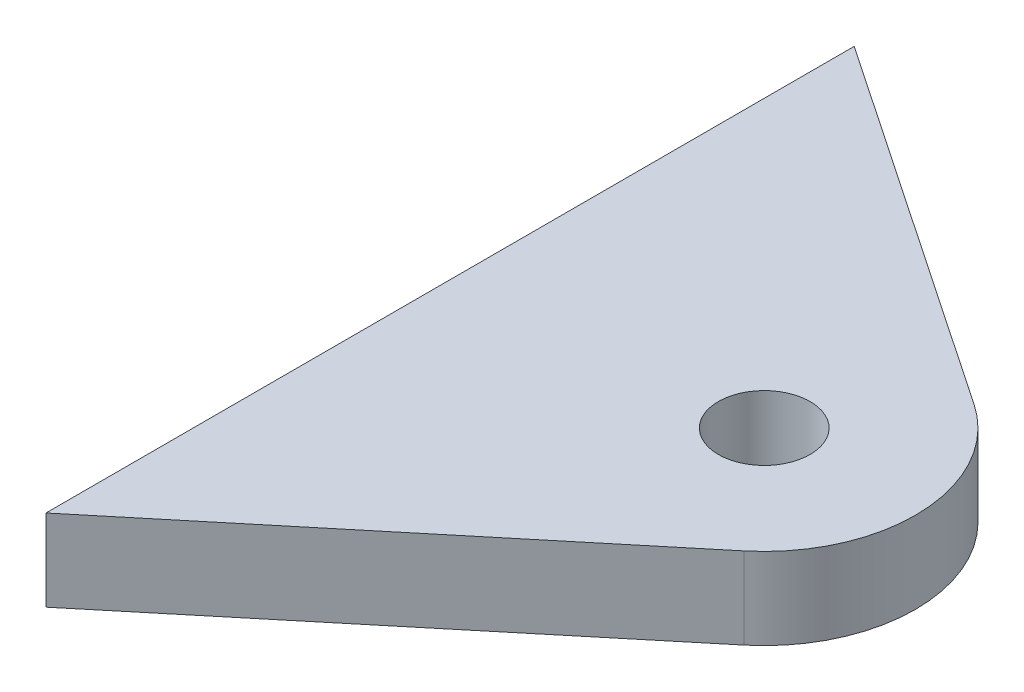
ISO-10303-21;
HEADER;
FILE_DESCRIPTION(('STEP AP214'),'2;1');
FILE_NAME('part.step','',(''),(''),'','','');
FILE_SCHEMA(('AUTOMOTIVE_DESIGN { 1 0 10303 214 1 1 1 1 }'));
ENDSEC;
DATA;
#1=APPLICATION_CONTEXT('core data for automotive mechanical design processes');
#2=APPLICATION_PROTOCOL_DEFINITION('international standard','automotive_design',2000,#1);
#3=PRODUCT_CONTEXT('',#1,'mechanical');
#4=PRODUCT('Part','Part','',(#3));
#5=PRODUCT_RELATED_PRODUCT_CATEGORY('part','',(#4));
#6=PRODUCT_DEFINITION_FORMATION('','',#4);
#7=PRODUCT_DEFINITION_CONTEXT('part definition',#1,'design');
#8=PRODUCT_DEFINITION('design','',#6,#7);
#9=PRODUCT_DEFINITION_SHAPE('','',#8);
#10=(LENGTH_UNIT() NAMED_UNIT(*) SI_UNIT(.MILLI.,.METRE.));
#11=(NAMED_UNIT(*) PLANE_ANGLE_UNIT() SI_UNIT($,.RADIAN.));
#12=(NAMED_UNIT(*) SI_UNIT($,.STERADIAN.) SOLID_ANGLE_UNIT());
#13=UNCERTAINTY_MEASURE_WITH_UNIT(LENGTH_MEASURE(1.E-05),#10,'distance_accuracy_value','');
#14=(GEOMETRIC_REPRESENTATION_CONTEXT(3) GLOBAL_UNCERTAINTY_ASSIGNED_CONTEXT((#13)) GLOBAL_UNIT_ASSIGNED_CONTEXT((#10,
#11,#12)) REPRESENTATION_CONTEXT('',''));
#15=CARTESIAN_POINT('',(0.,0.,0.));
#16=DIRECTION('',(0.,0.,1.));
#17=DIRECTION('',(1.,0.,0.));
#18=AXIS2_PLACEMENT_3D('',#15,#16,#17);
#19=CARTESIAN_POINT('',(0.,25.4,0.));
#20=DIRECTION('',(0.,1.,0.));
#21=DIRECTION('',(0.,0.,1.));
#22=AXIS2_PLACEMENT_3D('',#19,#20,#21);
#23=PLANE('',#22);
#24=CARTESIAN_POINT('',(0.,25.4,0.));
#25=DIRECTION('',(0.,1.,0.));
#26=DIRECTION('',(0.,0.,1.));
#27=AXIS2_PLACEMENT_3D('',#24,#25,#26);
#28=CIRCLE('',#27,47.0655824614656);
#29=CARTESIAN_POINT('',(30.0154566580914,25.4,36.2524676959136));
#30=VERTEX_POINT('',#29);
#31=CARTESIAN_POINT('',(26.3611203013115,25.4,-38.990516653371));
#32=VERTEX_POINT('',#31);
#33=EDGE_CURVE('E84',#30,#32,#28,.T.);
#34=ORIENTED_EDGE('',*,*,#33,.T.);
#35=DIRECTION('',(-0.828429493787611,0.,-0.560093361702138));
#36=VECTOR('',#35,1.);
#37=CARTESIAN_POINT('',(26.3611203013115,25.4,-38.990516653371));
#38=LINE('',#37,#36);
#39=CARTESIAN_POINT('',(-88.9,25.4,-116.917472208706));
#40=VERTEX_POINT('',#39);
#41=EDGE_CURVE('E79',#32,#40,#38,.T.);
#42=ORIENTED_EDGE('',*,*,#41,.T.);
#43=DIRECTION('',(0.,0.,1.));
#44=VECTOR('',#43,1.);
#45=CARTESIAN_POINT('',(-88.9,25.4,-116.917472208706));
#46=LINE('',#45,#44);
#47=CARTESIAN_POINT('',(-88.9,25.4,134.709261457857));
#48=VERTEX_POINT('',#47);
#49=EDGE_CURVE('E82',#40,#48,#46,.T.);
#50=ORIENTED_EDGE('',*,*,#49,.T.);
#51=DIRECTION('',(0.770254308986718,0.,-0.637736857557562));
#52=VECTOR('',#51,1.);
#53=CARTESIAN_POINT('',(-88.9,25.4,134.709261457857));
#54=LINE('',#53,#52);
#55=EDGE_CURVE('E49',#48,#30,#54,.T.);
#56=ORIENTED_EDGE('',*,*,#55,.T.);
#57=EDGE_LOOP('',(#34,#42,#50,#56));
#58=FACE_BOUND('',#57,.T.);
#59=CARTESIAN_POINT('',(0.,25.4,0.));
#60=DIRECTION('',(0.,1.,0.));
#61=DIRECTION('',(0.,0.,1.));
#62=AXIS2_PLACEMENT_3D('',#59,#60,#61);
#63=CIRCLE('',#62,14.2875);
#64=CARTESIAN_POINT('',(0.,25.4,14.2875));
#65=VERTEX_POINT('',#64);
#66=EDGE_CURVE('E99',#65,#65,#63,.T.);
#67=ORIENTED_EDGE('',*,*,#66,.F.);
#68=EDGE_LOOP('',(#67));
#69=FACE_BOUND('',#68,.T.);
#70=ADVANCED_FACE('F32',(#58,#69),#23,.T.);
#71=CARTESIAN_POINT('',(0.,0.,0.));
#72=DIRECTION('',(0.,1.,0.));
#73=DIRECTION('',(0.,0.,1.));
#74=AXIS2_PLACEMENT_3D('',#71,#72,#73);
#75=PLANE('',#74);
#76=CARTESIAN_POINT('',(0.,0.,0.));
#77=DIRECTION('',(0.,1.,0.));
#78=DIRECTION('',(0.,0.,1.));
#79=AXIS2_PLACEMENT_3D('',#76,#77,#78);
#80=CIRCLE('',#79,47.0655824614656);
#81=CARTESIAN_POINT('',(30.0154566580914,0.,36.2524676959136));
#82=VERTEX_POINT('',#81);
#83=CARTESIAN_POINT('',(26.3611203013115,0.,-38.990516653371));
#84=VERTEX_POINT('',#83);
#85=EDGE_CURVE('E96',#82,#84,#80,.T.);
#86=ORIENTED_EDGE('',*,*,#85,.F.);
#87=DIRECTION('',(0.770254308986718,0.,-0.637736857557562));
#88=VECTOR('',#87,1.);
#89=CARTESIAN_POINT('',(-88.9,0.,134.709261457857));
#90=LINE('',#89,#88);
#91=CARTESIAN_POINT('',(-88.9,0.,134.709261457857));
#92=VERTEX_POINT('',#91);
#93=EDGE_CURVE('E72',#92,#82,#90,.T.);
#94=ORIENTED_EDGE('',*,*,#93,.F.);
#95=DIRECTION('',(0.,0.,1.));
#96=VECTOR('',#95,1.);
#97=CARTESIAN_POINT('',(-88.9,0.,-116.917472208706));
#98=LINE('',#97,#96);
#99=CARTESIAN_POINT('',(-88.9,0.,-116.917472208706));
#100=VERTEX_POINT('',#99);
#101=EDGE_CURVE('E66',#100,#92,#98,.T.);
#102=ORIENTED_EDGE('',*,*,#101,.F.);
#103=DIRECTION('',(-0.828429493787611,0.,-0.560093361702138));
#104=VECTOR('',#103,1.);
#105=CARTESIAN_POINT('',(26.3611203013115,0.,-38.990516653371));
#106=LINE('',#105,#104);
#107=EDGE_CURVE('E88',#84,#100,#106,.T.);
#108=ORIENTED_EDGE('',*,*,#107,.F.);
#109=EDGE_LOOP('',(#86,#94,#102,#108));
#110=FACE_BOUND('',#109,.T.);
#111=CARTESIAN_POINT('',(0.,0.,0.));
#112=DIRECTION('',(0.,1.,0.));
#113=DIRECTION('',(0.,0.,1.));
#114=AXIS2_PLACEMENT_3D('',#111,#112,#113);
#115=CIRCLE('',#114,14.2875);
#116=CARTESIAN_POINT('',(0.,0.,14.2875));
#117=VERTEX_POINT('',#116);
#118=EDGE_CURVE('E111',#117,#117,#115,.T.);
#119=ORIENTED_EDGE('',*,*,#118,.T.);
#120=EDGE_LOOP('',(#119));
#121=FACE_BOUND('',#120,.T.);
#122=ADVANCED_FACE('F107',(#110,#121),#75,.F.);
#123=CARTESIAN_POINT('',(0.,25.4,0.));
#124=DIRECTION('',(0.,-1.,0.));
#125=DIRECTION('',(0.,0.,-1.));
#126=AXIS2_PLACEMENT_3D('',#123,#124,#125);
#127=CYLINDRICAL_SURFACE('',#126,47.0655824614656);
#128=ORIENTED_EDGE('',*,*,#85,.T.);
#129=DIRECTION('',(0.,-1.,0.));
#130=VECTOR('',#129,1.);
#131=CARTESIAN_POINT('',(26.3611203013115,25.4,-38.990516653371));
#132=LINE('',#131,#130);
#133=EDGE_CURVE('E11',#32,#84,#132,.T.);
#134=ORIENTED_EDGE('',*,*,#133,.F.);
#135=ORIENTED_EDGE('',*,*,#33,.F.);
#136=DIRECTION('',(0.,-1.,0.));
#137=VECTOR('',#136,1.);
#138=CARTESIAN_POINT('',(30.0154566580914,25.4,36.2524676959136));
#139=LINE('',#138,#137);
#140=EDGE_CURVE('E92',#30,#82,#139,.T.);
#141=ORIENTED_EDGE('',*,*,#140,.T.);
#142=EDGE_LOOP('',(#128,#134,#135,#141));
#143=FACE_BOUND('',#142,.T.);
#144=ADVANCED_FACE('F34',(#143),#127,.T.);
#145=CARTESIAN_POINT('',(26.3611203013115,25.4,-38.990516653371));
#146=DIRECTION('',(-0.560093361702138,0.,0.828429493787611));
#147=DIRECTION('',(0.828429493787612,0.,0.560093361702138));
#148=AXIS2_PLACEMENT_3D('',#145,#146,#147);
#149=PLANE('',#148);
#150=ORIENTED_EDGE('',*,*,#107,.T.);
#151=DIRECTION('',(0.,-1.,0.));
#152=VECTOR('',#151,1.);
#153=CARTESIAN_POINT('',(-88.9,25.4,-116.917472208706));
#154=LINE('',#153,#152);
#155=EDGE_CURVE('E41',#40,#100,#154,.T.);
#156=ORIENTED_EDGE('',*,*,#155,.F.);
#157=ORIENTED_EDGE('',*,*,#41,.F.);
#158=ORIENTED_EDGE('',*,*,#133,.T.);
#159=EDGE_LOOP('',(#150,#156,#157,#158));
#160=FACE_BOUND('',#159,.T.);
#161=ADVANCED_FACE('F87',(#160),#149,.F.);
#162=CARTESIAN_POINT('',(-88.9,25.4,-116.917472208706));
#163=DIRECTION('',(1.,0.,0.));
#164=DIRECTION('',(0.,0.,-1.));
#165=AXIS2_PLACEMENT_3D('',#162,#163,#164);
#166=PLANE('',#165);
#167=ORIENTED_EDGE('',*,*,#101,.T.);
#168=DIRECTION('',(0.,-1.,0.));
#169=VECTOR('',#168,1.);
#170=CARTESIAN_POINT('',(-88.9,25.4,134.709261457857));
#171=LINE('',#170,#169);
#172=EDGE_CURVE('E89',#48,#92,#171,.T.);
#173=ORIENTED_EDGE('',*,*,#172,.F.);
#174=ORIENTED_EDGE('',*,*,#49,.F.);
#175=ORIENTED_EDGE('',*,*,#155,.T.);
#176=EDGE_LOOP('',(#167,#173,#174,#175));
#177=FACE_BOUND('',#176,.T.);
#178=ADVANCED_FACE('F90',(#177),#166,.F.);
#179=CARTESIAN_POINT('',(-88.9,25.4,134.709261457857));
#180=DIRECTION('',(-0.637736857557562,0.,-0.770254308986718));
#181=DIRECTION('',(-0.770254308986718,0.,0.637736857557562));
#182=AXIS2_PLACEMENT_3D('',#179,#180,#181);
#183=PLANE('',#182);
#184=ORIENTED_EDGE('',*,*,#93,.T.);
#185=ORIENTED_EDGE('',*,*,#140,.F.);
#186=ORIENTED_EDGE('',*,*,#55,.F.);
#187=ORIENTED_EDGE('',*,*,#172,.T.);
#188=EDGE_LOOP('',(#184,#185,#186,#187));
#189=FACE_BOUND('',#188,.T.);
#190=ADVANCED_FACE('F104',(#189),#183,.F.);
#191=CARTESIAN_POINT('',(0.,25.4,0.));
#192=DIRECTION('',(0.,-1.,0.));
#193=DIRECTION('',(0.,0.,-1.));
#194=AXIS2_PLACEMENT_3D('',#191,#192,#193);
#195=CYLINDRICAL_SURFACE('',#194,14.2875);
#196=ORIENTED_EDGE('',*,*,#66,.T.);
#197=EDGE_LOOP('',(#196));
#198=FACE_BOUND('',#197,.T.);
#199=ORIENTED_EDGE('',*,*,#118,.F.);
#200=EDGE_LOOP('',(#199));
#201=FACE_BOUND('',#200,.T.);
#202=ADVANCED_FACE('F117',(#198,#201),#195,.F.);
#203=CLOSED_SHELL('',(#70,#122,#144,#161,#178,#190,#202));
#204=MANIFOLD_SOLID_BREP('B2',#203);
#205=ADVANCED_BREP_SHAPE_REPRESENTATION('',(#18,#204),#14);
#206=SHAPE_DEFINITION_REPRESENTATION(#9,#205);
ENDSEC;
END-ISO-10303-21;
